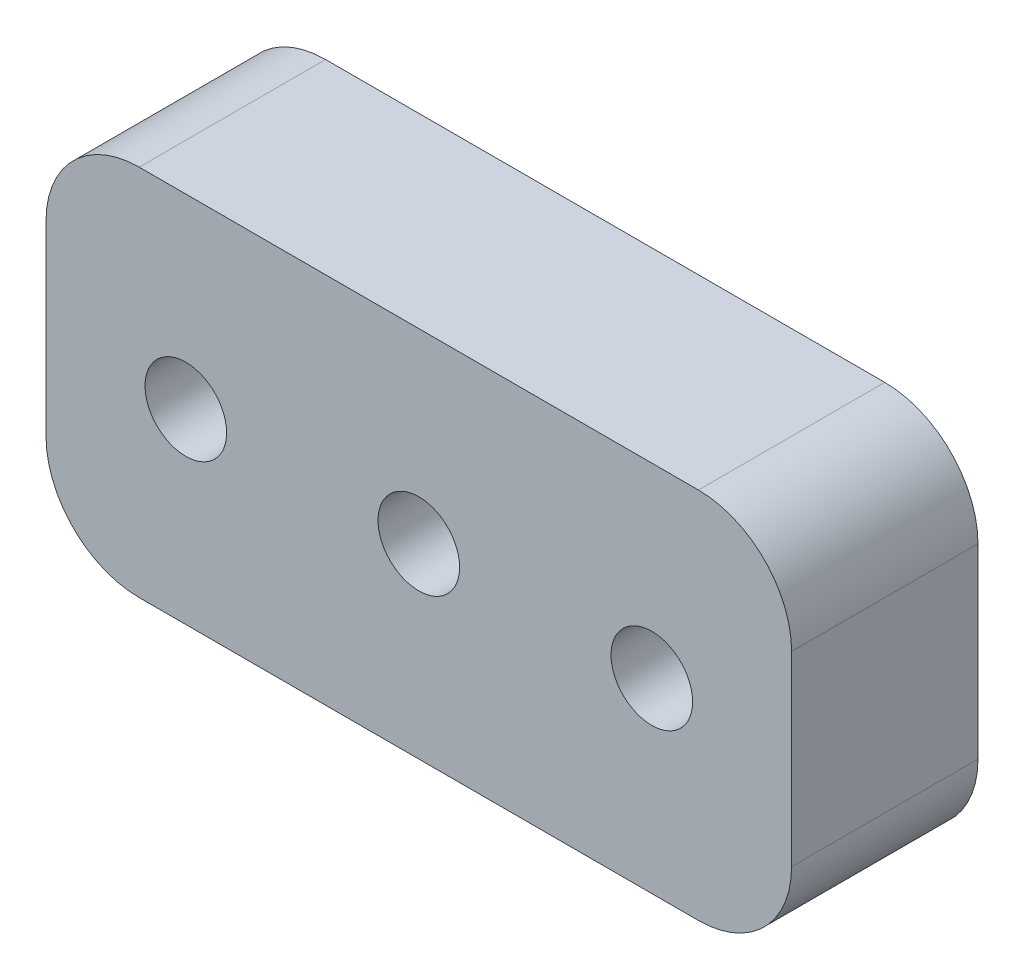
from build123d import *

# Parameters (mm, degrees)
SKETCH1_W           = 50.8
SKETCH1_H           = 25.4
SKETCH1_R           = 2.77876
BOSS_EXTRUDE1_DEPTH = 12.7
FILLET1_R           = 6.35


with BuildPart() as part:
    # Sketch1 → Boss-Extrude1 (new body)
    with BuildSketch(Plane.XY):
        Rectangle(SKETCH1_W, SKETCH1_H)
        with Locations((15.875, 0)):
            Circle(SKETCH1_R, mode=Mode.SUBTRACT)
        Circle(SKETCH1_R, mode=Mode.SUBTRACT)
        with Locations((-15.875, 0)):
            Circle(SKETCH1_R, mode=Mode.SUBTRACT)
    extrude(amount=BOSS_EXTRUDE1_DEPTH)

    # Fillet1
    fillet1_edges = [part.edges().sort_by_distance(p)[0] for p in [
        (25.4, -12.7, 6.35),
        (-25.4, -12.7, 6.35),
        (-25.4, 12.7, 6.35),
        (25.4, 12.7, 6.35),
    ]]
    fillet(fillet1_edges, radius=FILLET1_R)


solid = part.part
